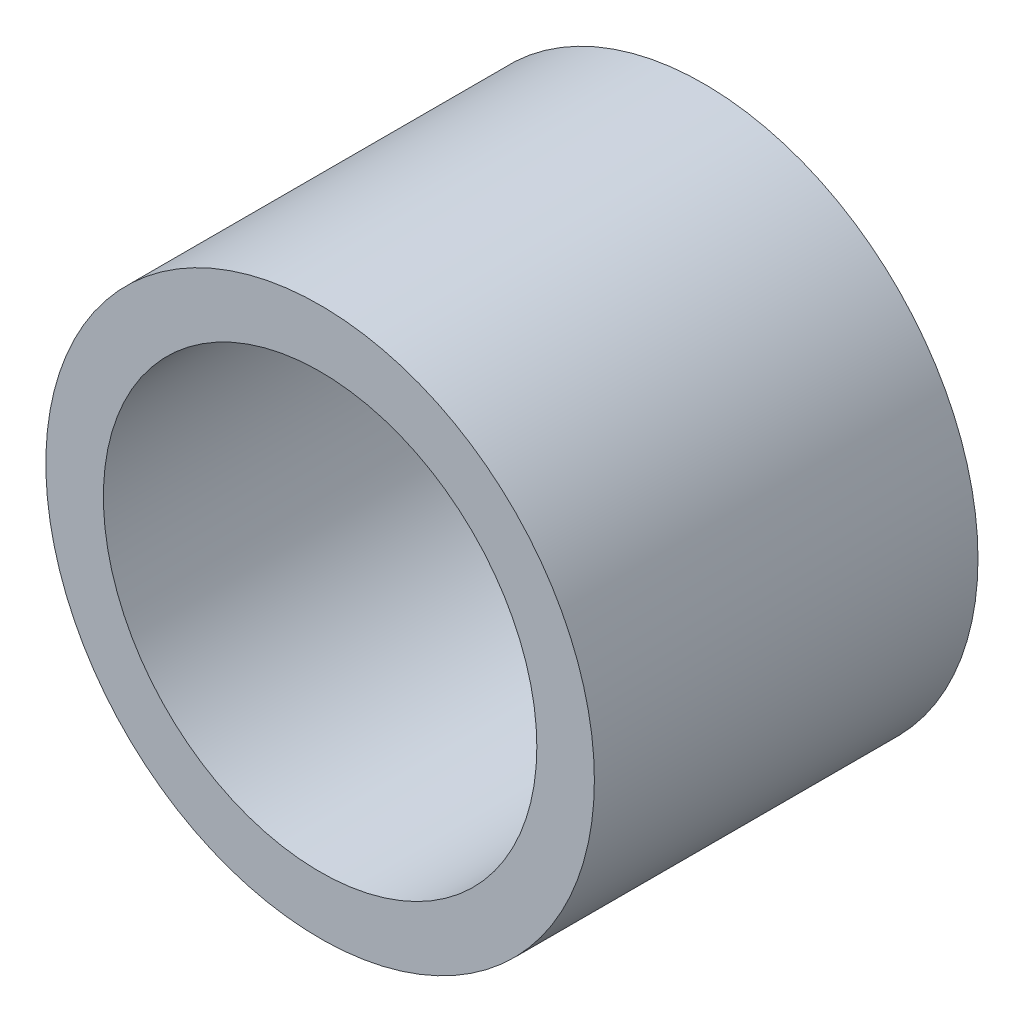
from build123d import *

# Parameters (mm, degrees)
ESQUISSE1_R          = 7.15
ESQUISSE1_R_2        = 5.65
BASE_EXTRUSION_DEPTH = 10


with BuildPart() as part:
    # Esquisse1 → Base-Extrusion (new body)
    with BuildSketch(Plane.XY):
        Circle(ESQUISSE1_R)
        Circle(ESQUISSE1_R_2, mode=Mode.SUBTRACT)
    extrude(amount=BASE_EXTRUSION_DEPTH)


solid = part.part
